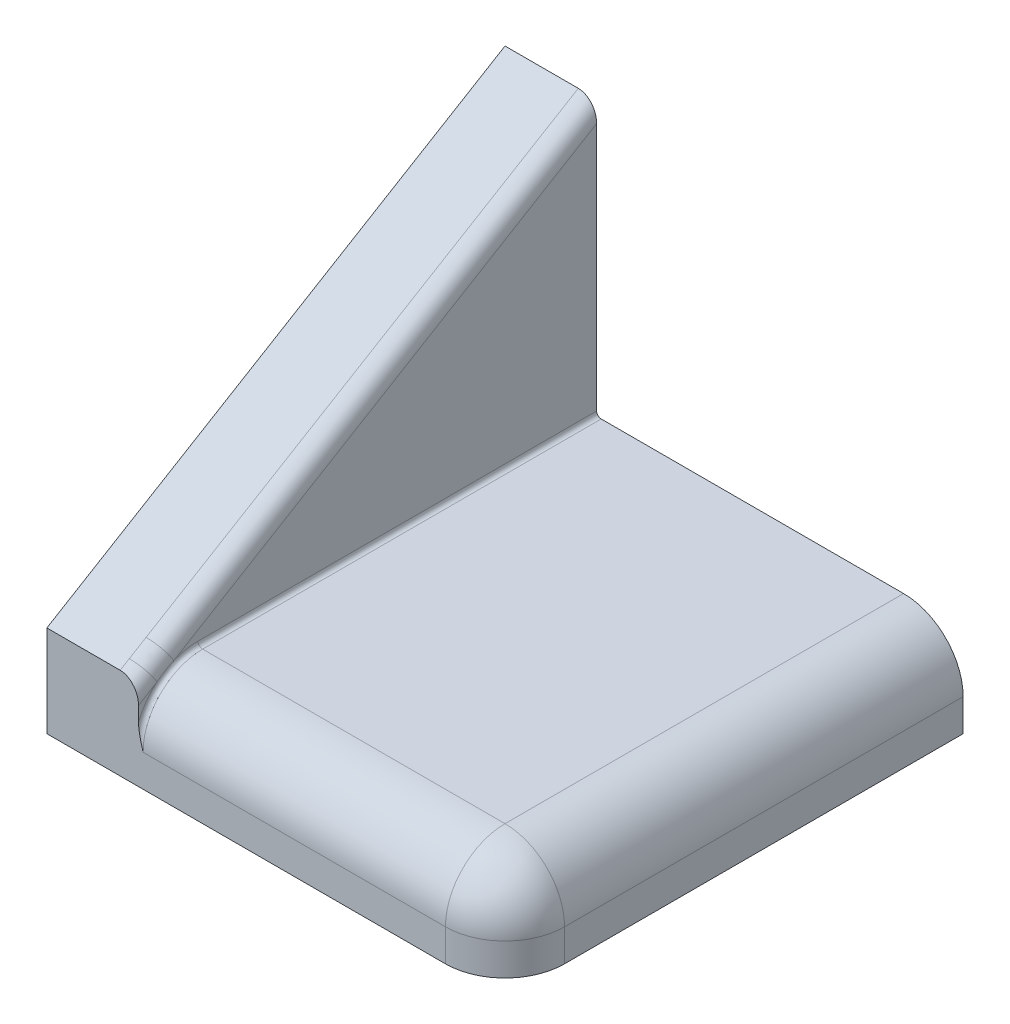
from build123d import *

# Parameters (mm, degrees)
SKETCH4_W           = 50
SKETCH4_H           = 50
BOSS_EXTRUDE1_DEPTH = 10
BOSS_EXTRUDE2_DEPTH = 10
FILLET2_R           = 6.5
FILLET3_R           = 0.5
FILLET4_R           = 2
FILLET5_R           = 6.5


with BuildPart() as part:
    # Sketch4 → Boss-Extrude1 (new body)
    with BuildSketch(Plane(origin=(0, 0, 0), x_dir=(1, 0, 0), z_dir=(0, 1, 0))):
        with Locations((-0.945378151, -6.722689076)):
            Rectangle(SKETCH4_W, SKETCH4_H)
    extrude(amount=BOSS_EXTRUDE1_DEPTH)

    # Sketch6 → Boss-Extrude2 (add)
    with BuildSketch(Plane.ZY.offset(25.945378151)):
        Polygon((-18.277310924, 10), (-18.277310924, 40), (31.722689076, 10), align=None)
    extrude(amount=-BOSS_EXTRUDE2_DEPTH)

    # Fillet2
    fillet2_edges = [part.edges().sort_by_distance(p)[0] for p in [
        (4.054621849, 10, 31.722689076),
    ]]
    fillet(fillet2_edges, radius=FILLET2_R)

    # Fillet3
    fillet3_edges = [part.edges().sort_by_distance(p)[0] for p in [
        (-15.945378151, 8.096194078, 29.818883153),
        (-15.945378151, 10, 3.472689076),
    ]]
    fillet(fillet3_edges, radius=FILLET3_R)

    # Fillet4
    fillet4_edges = [part.edges().sort_by_distance(p)[0] for p in [
        (-15.945378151, 25, 6.722689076),
    ]]
    fillet(fillet4_edges, radius=FILLET4_R)

    # Fillet5
    fillet5_edges = [part.edges().sort_by_distance(p)[0] for p in [
        (24.054621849, 1.75, 31.722689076),
        (24.054621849, 8.096194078, 29.818883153),
        (24.054621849, 10, 3.472689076),
    ]]
    fillet(fillet5_edges, radius=FILLET5_R)


solid = part.part
